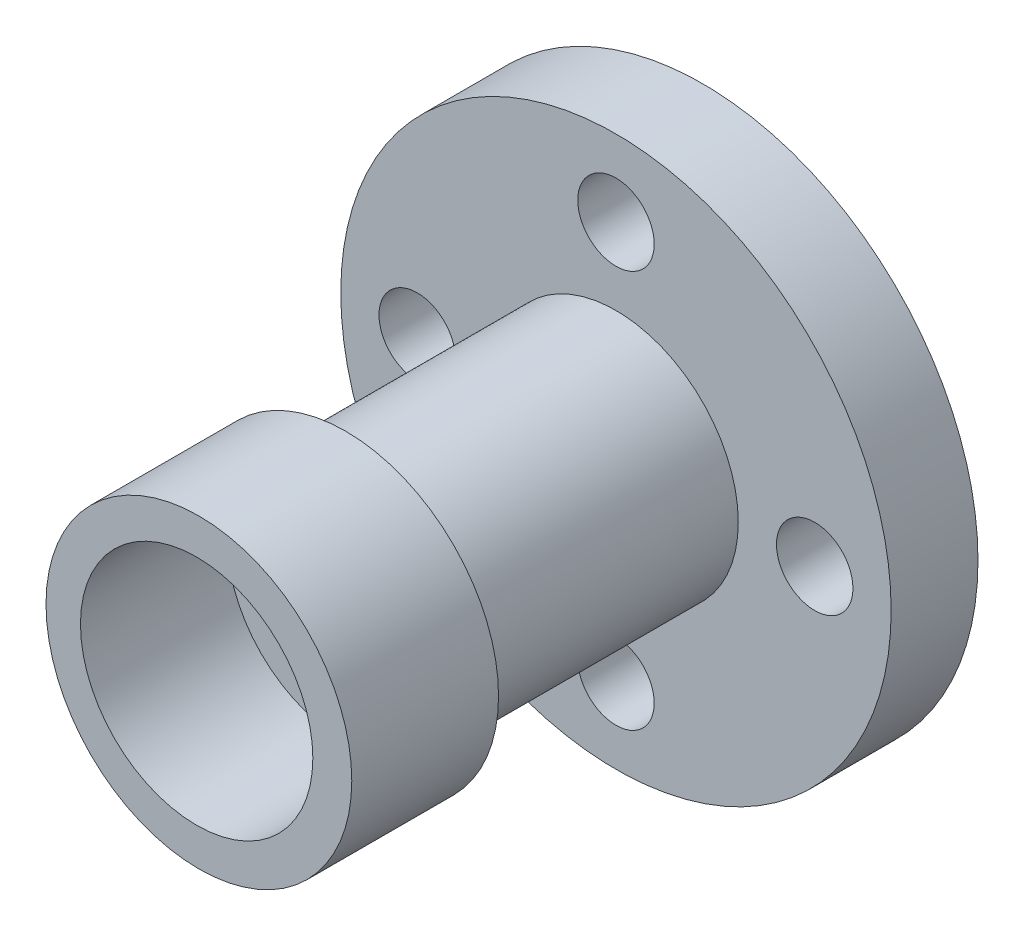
ISO-10303-21;
HEADER;
FILE_DESCRIPTION(('STEP AP214'),'2;1');
FILE_NAME('part.step','',(''),(''),'','','');
FILE_SCHEMA(('AUTOMOTIVE_DESIGN { 1 0 10303 214 1 1 1 1 }'));
ENDSEC;
DATA;
#1=APPLICATION_CONTEXT('core data for automotive mechanical design processes');
#2=APPLICATION_PROTOCOL_DEFINITION('international standard','automotive_design',2000,#1);
#3=PRODUCT_CONTEXT('',#1,'mechanical');
#4=PRODUCT('Part','Part','',(#3));
#5=PRODUCT_RELATED_PRODUCT_CATEGORY('part','',(#4));
#6=PRODUCT_DEFINITION_FORMATION('','',#4);
#7=PRODUCT_DEFINITION_CONTEXT('part definition',#1,'design');
#8=PRODUCT_DEFINITION('design','',#6,#7);
#9=PRODUCT_DEFINITION_SHAPE('','',#8);
#10=(LENGTH_UNIT() NAMED_UNIT(*) SI_UNIT(.MILLI.,.METRE.));
#11=(NAMED_UNIT(*) PLANE_ANGLE_UNIT() SI_UNIT($,.RADIAN.));
#12=(NAMED_UNIT(*) SI_UNIT($,.STERADIAN.) SOLID_ANGLE_UNIT());
#13=UNCERTAINTY_MEASURE_WITH_UNIT(LENGTH_MEASURE(1.E-05),#10,'distance_accuracy_value','');
#14=(GEOMETRIC_REPRESENTATION_CONTEXT(3) GLOBAL_UNCERTAINTY_ASSIGNED_CONTEXT((#13)) GLOBAL_UNIT_ASSIGNED_CONTEXT((#10,
#11,#12)) REPRESENTATION_CONTEXT('',''));
#15=CARTESIAN_POINT('',(0.,0.,0.));
#16=DIRECTION('',(0.,0.,1.));
#17=DIRECTION('',(1.,0.,0.));
#18=AXIS2_PLACEMENT_3D('',#15,#16,#17);
#19=CARTESIAN_POINT('',(0.,0.,58.4));
#20=DIRECTION('',(0.,0.,1.));
#21=DIRECTION('',(1.,0.,0.));
#22=AXIS2_PLACEMENT_3D('',#19,#20,#21);
#23=PLANE('',#22);
#24=CARTESIAN_POINT('',(0.,0.,58.4));
#25=DIRECTION('',(0.,0.,1.));
#26=DIRECTION('',(1.,0.,0.));
#27=AXIS2_PLACEMENT_3D('',#24,#25,#26);
#28=CIRCLE('',#27,15.);
#29=CARTESIAN_POINT('',(15.,0.,58.4));
#30=VERTEX_POINT('',#29);
#31=EDGE_CURVE('E91',#30,#30,#28,.T.);
#32=ORIENTED_EDGE('',*,*,#31,.F.);
#33=EDGE_LOOP('',(#32));
#34=FACE_BOUND('',#33,.T.);
#35=CARTESIAN_POINT('',(-0.365479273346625,0.,58.4));
#36=DIRECTION('',(0.,0.,1.));
#37=DIRECTION('',(1.,0.,0.));
#38=AXIS2_PLACEMENT_3D('',#35,#36,#37);
#39=CIRCLE('',#38,19.);
#40=CARTESIAN_POINT('',(18.6345207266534,0.,58.4));
#41=VERTEX_POINT('',#40);
#42=EDGE_CURVE('E71',#41,#41,#39,.F.);
#43=ORIENTED_EDGE('',*,*,#42,.F.);
#44=EDGE_LOOP('',(#43));
#45=FACE_BOUND('',#44,.T.);
#46=ADVANCED_FACE('F57',(#34,#45),#23,.T.);
#47=CARTESIAN_POINT('',(0.,0.,14.2));
#48=DIRECTION('',(0.,0.,1.));
#49=DIRECTION('',(1.,0.,0.));
#50=AXIS2_PLACEMENT_3D('',#47,#48,#49);
#51=PLANE('',#50);
#52=CARTESIAN_POINT('',(0.,32.5,14.2));
#53=DIRECTION('',(0.,0.,1.));
#54=DIRECTION('',(1.,0.,0.));
#55=AXIS2_PLACEMENT_3D('',#52,#53,#54);
#56=CIRCLE('',#55,6.25);
#57=CARTESIAN_POINT('',(6.25,32.5,14.2));
#58=VERTEX_POINT('',#57);
#59=EDGE_CURVE('E110',#58,#58,#56,.T.);
#60=ORIENTED_EDGE('',*,*,#59,.F.);
#61=EDGE_LOOP('',(#60));
#62=FACE_BOUND('',#61,.T.);
#63=CARTESIAN_POINT('',(-32.5,-1.13473143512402E-13,14.2));
#64=DIRECTION('',(0.,0.,1.));
#65=DIRECTION('',(1.,0.,0.));
#66=AXIS2_PLACEMENT_3D('',#63,#64,#65);
#67=CIRCLE('',#66,6.25);
#68=CARTESIAN_POINT('',(-26.25,-1.13473143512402E-13,14.2));
#69=VERTEX_POINT('',#68);
#70=EDGE_CURVE('E114',#69,#69,#67,.T.);
#71=ORIENTED_EDGE('',*,*,#70,.F.);
#72=EDGE_LOOP('',(#71));
#73=FACE_BOUND('',#72,.T.);
#74=CARTESIAN_POINT('',(2.26946287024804E-13,-32.5,14.2));
#75=DIRECTION('',(0.,0.,1.));
#76=DIRECTION('',(1.,0.,0.));
#77=AXIS2_PLACEMENT_3D('',#74,#75,#76);
#78=CIRCLE('',#77,6.25);
#79=CARTESIAN_POINT('',(6.25000000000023,-32.5,14.2));
#80=VERTEX_POINT('',#79);
#81=EDGE_CURVE('E118',#80,#80,#78,.T.);
#82=ORIENTED_EDGE('',*,*,#81,.F.);
#83=EDGE_LOOP('',(#82));
#84=FACE_BOUND('',#83,.T.);
#85=CARTESIAN_POINT('',(32.5,3.40419430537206E-13,14.2));
#86=DIRECTION('',(0.,0.,1.));
#87=DIRECTION('',(1.,0.,0.));
#88=AXIS2_PLACEMENT_3D('',#85,#86,#87);
#89=CIRCLE('',#88,6.25);
#90=CARTESIAN_POINT('',(38.75,3.40419430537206E-13,14.2));
#91=VERTEX_POINT('',#90);
#92=EDGE_CURVE('E122',#91,#91,#89,.T.);
#93=ORIENTED_EDGE('',*,*,#92,.F.);
#94=EDGE_LOOP('',(#93));
#95=FACE_BOUND('',#94,.T.);
#96=CARTESIAN_POINT('',(0.,0.,14.2));
#97=DIRECTION('',(0.,0.,1.));
#98=DIRECTION('',(1.,0.,0.));
#99=AXIS2_PLACEMENT_3D('',#96,#97,#98);
#100=CIRCLE('',#99,45.);
#101=CARTESIAN_POINT('',(45.,0.,14.2));
#102=VERTEX_POINT('',#101);
#103=EDGE_CURVE('E76',#102,#102,#100,.T.);
#104=ORIENTED_EDGE('',*,*,#103,.T.);
#105=EDGE_LOOP('',(#104));
#106=FACE_BOUND('',#105,.T.);
#107=CARTESIAN_POINT('',(0.,0.,14.2));
#108=DIRECTION('',(0.,0.,1.));
#109=DIRECTION('',(1.,0.,0.));
#110=AXIS2_PLACEMENT_3D('',#107,#108,#109);
#111=CIRCLE('',#110,20.);
#112=CARTESIAN_POINT('',(20.,0.,14.2));
#113=VERTEX_POINT('',#112);
#114=EDGE_CURVE('E87',#113,#113,#111,.T.);
#115=ORIENTED_EDGE('',*,*,#114,.F.);
#116=EDGE_LOOP('',(#115));
#117=FACE_BOUND('',#116,.T.);
#118=ADVANCED_FACE('F149',(#62,#73,#84,#95,#106,#117),#51,.T.);
#119=CARTESIAN_POINT('',(0.,0.,0.));
#120=DIRECTION('',(0.,0.,1.));
#121=DIRECTION('',(1.,0.,0.));
#122=AXIS2_PLACEMENT_3D('',#119,#120,#121);
#123=PLANE('',#122);
#124=CARTESIAN_POINT('',(0.,32.5,0.));
#125=DIRECTION('',(0.,0.,-1.));
#126=DIRECTION('',(-1.,0.,0.));
#127=AXIS2_PLACEMENT_3D('',#124,#125,#126);
#128=CIRCLE('',#127,6.25);
#129=CARTESIAN_POINT('',(-6.25,32.5,0.));
#130=VERTEX_POINT('',#129);
#131=EDGE_CURVE('E126',#130,#130,#128,.T.);
#132=ORIENTED_EDGE('',*,*,#131,.F.);
#133=EDGE_LOOP('',(#132));
#134=FACE_BOUND('',#133,.T.);
#135=CARTESIAN_POINT('',(-32.5,-1.13473143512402E-13,0.));
#136=DIRECTION('',(0.,0.,-1.));
#137=DIRECTION('',(-1.,0.,0.));
#138=AXIS2_PLACEMENT_3D('',#135,#136,#137);
#139=CIRCLE('',#138,6.25);
#140=CARTESIAN_POINT('',(-38.75,-1.13473143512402E-13,0.));
#141=VERTEX_POINT('',#140);
#142=EDGE_CURVE('E135',#141,#141,#139,.T.);
#143=ORIENTED_EDGE('',*,*,#142,.F.);
#144=EDGE_LOOP('',(#143));
#145=FACE_BOUND('',#144,.T.);
#146=CARTESIAN_POINT('',(2.26946287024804E-13,-32.5,0.));
#147=DIRECTION('',(0.,0.,-1.));
#148=DIRECTION('',(-1.,0.,0.));
#149=AXIS2_PLACEMENT_3D('',#146,#147,#148);
#150=CIRCLE('',#149,6.25);
#151=CARTESIAN_POINT('',(-6.24999999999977,-32.5,0.));
#152=VERTEX_POINT('',#151);
#153=EDGE_CURVE('E131',#152,#152,#150,.T.);
#154=ORIENTED_EDGE('',*,*,#153,.F.);
#155=EDGE_LOOP('',(#154));
#156=FACE_BOUND('',#155,.T.);
#157=CARTESIAN_POINT('',(32.5,3.40419430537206E-13,0.));
#158=DIRECTION('',(0.,0.,-1.));
#159=DIRECTION('',(-1.,0.,0.));
#160=AXIS2_PLACEMENT_3D('',#157,#158,#159);
#161=CIRCLE('',#160,6.25);
#162=CARTESIAN_POINT('',(26.25,3.40419430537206E-13,0.));
#163=VERTEX_POINT('',#162);
#164=EDGE_CURVE('E127',#163,#163,#161,.T.);
#165=ORIENTED_EDGE('',*,*,#164,.F.);
#166=EDGE_LOOP('',(#165));
#167=FACE_BOUND('',#166,.T.);
#168=CARTESIAN_POINT('',(0.,0.,0.));
#169=DIRECTION('',(0.,0.,1.));
#170=DIRECTION('',(1.,0.,0.));
#171=AXIS2_PLACEMENT_3D('',#168,#169,#170);
#172=CIRCLE('',#171,18.5);
#173=CARTESIAN_POINT('',(18.5,0.,0.));
#174=VERTEX_POINT('',#173);
#175=EDGE_CURVE('E66',#174,#174,#172,.T.);
#176=ORIENTED_EDGE('',*,*,#175,.T.);
#177=EDGE_LOOP('',(#176));
#178=FACE_BOUND('',#177,.T.);
#179=CARTESIAN_POINT('',(0.,0.,0.));
#180=DIRECTION('',(0.,0.,1.));
#181=DIRECTION('',(1.,0.,0.));
#182=AXIS2_PLACEMENT_3D('',#179,#180,#181);
#183=CIRCLE('',#182,45.);
#184=CARTESIAN_POINT('',(45.,0.,0.));
#185=VERTEX_POINT('',#184);
#186=EDGE_CURVE('E79',#185,#185,#183,.T.);
#187=ORIENTED_EDGE('',*,*,#186,.F.);
#188=EDGE_LOOP('',(#187));
#189=FACE_BOUND('',#188,.T.);
#190=ADVANCED_FACE('F145',(#134,#145,#156,#167,#178,#189),#123,.F.);
#191=CARTESIAN_POINT('',(0.,0.,14.2));
#192=DIRECTION('',(0.,0.,-1.));
#193=DIRECTION('',(-1.,0.,0.));
#194=AXIS2_PLACEMENT_3D('',#191,#192,#193);
#195=CYLINDRICAL_SURFACE('',#194,45.);
#196=ORIENTED_EDGE('',*,*,#103,.F.);
#197=EDGE_LOOP('',(#196));
#198=FACE_BOUND('',#197,.T.);
#199=ORIENTED_EDGE('',*,*,#186,.T.);
#200=EDGE_LOOP('',(#199));
#201=FACE_BOUND('',#200,.T.);
#202=ADVANCED_FACE('F148',(#198,#201),#195,.T.);
#203=CARTESIAN_POINT('',(0.,0.,14.2));
#204=DIRECTION('',(0.,0.,-1.));
#205=DIRECTION('',(-1.,0.,0.));
#206=AXIS2_PLACEMENT_3D('',#203,#204,#205);
#207=CYLINDRICAL_SURFACE('',#206,15.);
#208=CARTESIAN_POINT('',(0.,0.,3.00000000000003));
#209=DIRECTION('',(0.,0.,1.));
#210=DIRECTION('',(1.,0.,0.));
#211=AXIS2_PLACEMENT_3D('',#208,#209,#210);
#212=CIRCLE('',#211,15.);
#213=CARTESIAN_POINT('',(15.,0.,3.00000000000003));
#214=VERTEX_POINT('',#213);
#215=EDGE_CURVE('E11',#214,#214,#212,.F.);
#216=ORIENTED_EDGE('',*,*,#215,.T.);
#217=EDGE_LOOP('',(#216));
#218=FACE_BOUND('',#217,.T.);
#219=ORIENTED_EDGE('',*,*,#31,.T.);
#220=EDGE_LOOP('',(#219));
#221=FACE_BOUND('',#220,.T.);
#222=ADVANCED_FACE('F160',(#218,#221),#207,.F.);
#223=CARTESIAN_POINT('',(0.,0.,58.4));
#224=DIRECTION('',(0.,0.,-1.));
#225=DIRECTION('',(-1.,0.,0.));
#226=AXIS2_PLACEMENT_3D('',#223,#224,#225);
#227=CYLINDRICAL_SURFACE('',#226,20.);
#228=CARTESIAN_POINT('',(0.,0.,58.4));
#229=DIRECTION('',(0.,0.,1.));
#230=DIRECTION('',(1.,0.,0.));
#231=AXIS2_PLACEMENT_3D('',#228,#229,#230);
#232=CIRCLE('',#231,20.);
#233=CARTESIAN_POINT('',(20.,0.,58.4));
#234=VERTEX_POINT('',#233);
#235=EDGE_CURVE('E83',#234,#234,#232,.T.);
#236=ORIENTED_EDGE('',*,*,#235,.F.);
#237=EDGE_LOOP('',(#236));
#238=FACE_BOUND('',#237,.T.);
#239=ORIENTED_EDGE('',*,*,#114,.T.);
#240=EDGE_LOOP('',(#239));
#241=FACE_BOUND('',#240,.T.);
#242=ADVANCED_FACE('F166',(#238,#241),#227,.T.);
#243=CARTESIAN_POINT('',(0.,0.,82.4));
#244=DIRECTION('',(0.,0.,1.));
#245=DIRECTION('',(1.,0.,0.));
#246=AXIS2_PLACEMENT_3D('',#243,#244,#245);
#247=PLANE('',#246);
#248=CARTESIAN_POINT('',(0.,0.,82.4));
#249=DIRECTION('',(0.,0.,1.));
#250=DIRECTION('',(1.,0.,0.));
#251=AXIS2_PLACEMENT_3D('',#248,#249,#250);
#252=CIRCLE('',#251,25.);
#253=CARTESIAN_POINT('',(25.,0.,82.4));
#254=VERTEX_POINT('',#253);
#255=EDGE_CURVE('E98',#254,#254,#252,.T.);
#256=ORIENTED_EDGE('',*,*,#255,.T.);
#257=EDGE_LOOP('',(#256));
#258=FACE_BOUND('',#257,.T.);
#259=CARTESIAN_POINT('',(-0.365479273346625,0.,82.4));
#260=DIRECTION('',(0.,0.,1.));
#261=DIRECTION('',(1.,0.,0.));
#262=AXIS2_PLACEMENT_3D('',#259,#260,#261);
#263=CIRCLE('',#262,19.);
#264=CARTESIAN_POINT('',(18.6345207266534,0.,82.4));
#265=VERTEX_POINT('',#264);
#266=EDGE_CURVE('E103',#265,#265,#263,.T.);
#267=ORIENTED_EDGE('',*,*,#266,.F.);
#268=EDGE_LOOP('',(#267));
#269=FACE_BOUND('',#268,.T.);
#270=ADVANCED_FACE('F184',(#258,#269),#247,.T.);
#271=CARTESIAN_POINT('',(0.,0.,58.4));
#272=DIRECTION('',(0.,0.,1.));
#273=DIRECTION('',(1.,0.,0.));
#274=AXIS2_PLACEMENT_3D('',#271,#272,#273);
#275=PLANE('',#274);
#276=ORIENTED_EDGE('',*,*,#235,.T.);
#277=EDGE_LOOP('',(#276));
#278=FACE_BOUND('',#277,.T.);
#279=CARTESIAN_POINT('',(0.,0.,58.4));
#280=DIRECTION('',(0.,0.,1.));
#281=DIRECTION('',(1.,0.,0.));
#282=AXIS2_PLACEMENT_3D('',#279,#280,#281);
#283=CIRCLE('',#282,25.);
#284=CARTESIAN_POINT('',(25.,0.,58.4));
#285=VERTEX_POINT('',#284);
#286=EDGE_CURVE('E99',#285,#285,#283,.T.);
#287=ORIENTED_EDGE('',*,*,#286,.F.);
#288=EDGE_LOOP('',(#287));
#289=FACE_BOUND('',#288,.T.);
#290=ADVANCED_FACE('F188',(#278,#289),#275,.F.);
#291=CARTESIAN_POINT('',(0.,0.,82.4));
#292=DIRECTION('',(0.,0.,-1.));
#293=DIRECTION('',(-1.,0.,0.));
#294=AXIS2_PLACEMENT_3D('',#291,#292,#293);
#295=CYLINDRICAL_SURFACE('',#294,25.);
#296=ORIENTED_EDGE('',*,*,#255,.F.);
#297=EDGE_LOOP('',(#296));
#298=FACE_BOUND('',#297,.T.);
#299=ORIENTED_EDGE('',*,*,#286,.T.);
#300=EDGE_LOOP('',(#299));
#301=FACE_BOUND('',#300,.T.);
#302=ADVANCED_FACE('F182',(#298,#301),#295,.T.);
#303=CARTESIAN_POINT('',(-0.365479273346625,0.,82.4));
#304=DIRECTION('',(0.,0.,-1.));
#305=DIRECTION('',(-1.,0.,0.));
#306=AXIS2_PLACEMENT_3D('',#303,#304,#305);
#307=CYLINDRICAL_SURFACE('',#306,19.);
#308=ORIENTED_EDGE('',*,*,#266,.T.);
#309=EDGE_LOOP('',(#308));
#310=FACE_BOUND('',#309,.T.);
#311=ORIENTED_EDGE('',*,*,#42,.T.);
#312=EDGE_LOOP('',(#311));
#313=FACE_BOUND('',#312,.T.);
#314=ADVANCED_FACE('F201',(#310,#313),#307,.F.);
#315=CARTESIAN_POINT('',(0.,0.,0.));
#316=DIRECTION('',(0.,0.,-1.));
#317=DIRECTION('',(-1.,0.,0.));
#318=AXIS2_PLACEMENT_3D('',#315,#316,#317);
#319=CONICAL_SURFACE('',#318,18.5,0.862170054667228);
#320=ORIENTED_EDGE('',*,*,#215,.F.);
#321=EDGE_LOOP('',(#320));
#322=FACE_BOUND('',#321,.T.);
#323=ORIENTED_EDGE('',*,*,#175,.F.);
#324=EDGE_LOOP('',(#323));
#325=FACE_BOUND('',#324,.T.);
#326=ADVANCED_FACE('F60',(#322,#325),#319,.F.);
#327=CARTESIAN_POINT('',(32.5,3.40419430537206E-13,44.2));
#328=DIRECTION('',(0.,0.,-1.));
#329=DIRECTION('',(-1.,0.,0.));
#330=AXIS2_PLACEMENT_3D('',#327,#328,#329);
#331=CYLINDRICAL_SURFACE('',#330,6.25);
#332=ORIENTED_EDGE('',*,*,#92,.T.);
#333=EDGE_LOOP('',(#332));
#334=FACE_BOUND('',#333,.T.);
#335=ORIENTED_EDGE('',*,*,#164,.T.);
#336=EDGE_LOOP('',(#335));
#337=FACE_BOUND('',#336,.T.);
#338=ADVANCED_FACE('F216',(#334,#337),#331,.F.);
#339=CARTESIAN_POINT('',(2.26946287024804E-13,-32.5,44.2));
#340=DIRECTION('',(0.,0.,-1.));
#341=DIRECTION('',(-1.,0.,0.));
#342=AXIS2_PLACEMENT_3D('',#339,#340,#341);
#343=CYLINDRICAL_SURFACE('',#342,6.25);
#344=ORIENTED_EDGE('',*,*,#81,.T.);
#345=EDGE_LOOP('',(#344));
#346=FACE_BOUND('',#345,.T.);
#347=ORIENTED_EDGE('',*,*,#153,.T.);
#348=EDGE_LOOP('',(#347));
#349=FACE_BOUND('',#348,.T.);
#350=ADVANCED_FACE('F221',(#346,#349),#343,.F.);
#351=CARTESIAN_POINT('',(-32.5,-1.13473143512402E-13,44.2));
#352=DIRECTION('',(0.,0.,-1.));
#353=DIRECTION('',(-1.,0.,0.));
#354=AXIS2_PLACEMENT_3D('',#351,#352,#353);
#355=CYLINDRICAL_SURFACE('',#354,6.25);
#356=ORIENTED_EDGE('',*,*,#70,.T.);
#357=EDGE_LOOP('',(#356));
#358=FACE_BOUND('',#357,.T.);
#359=ORIENTED_EDGE('',*,*,#142,.T.);
#360=EDGE_LOOP('',(#359));
#361=FACE_BOUND('',#360,.T.);
#362=ADVANCED_FACE('F225',(#358,#361),#355,.F.);
#363=CARTESIAN_POINT('',(0.,32.5,44.2));
#364=DIRECTION('',(0.,0.,-1.));
#365=DIRECTION('',(-1.,0.,0.));
#366=AXIS2_PLACEMENT_3D('',#363,#364,#365);
#367=CYLINDRICAL_SURFACE('',#366,6.25);
#368=ORIENTED_EDGE('',*,*,#59,.T.);
#369=EDGE_LOOP('',(#368));
#370=FACE_BOUND('',#369,.T.);
#371=ORIENTED_EDGE('',*,*,#131,.T.);
#372=EDGE_LOOP('',(#371));
#373=FACE_BOUND('',#372,.T.);
#374=ADVANCED_FACE('F143',(#370,#373),#367,.F.);
#375=CLOSED_SHELL('',(#46,#118,#190,#202,#222,#242,#270,#290,#302,#314,#326,#338,#350,#362,#374));
#376=MANIFOLD_SOLID_BREP('B2',#375);
#377=ADVANCED_BREP_SHAPE_REPRESENTATION('',(#18,#376),#14);
#378=SHAPE_DEFINITION_REPRESENTATION(#9,#377);
ENDSEC;
END-ISO-10303-21;
